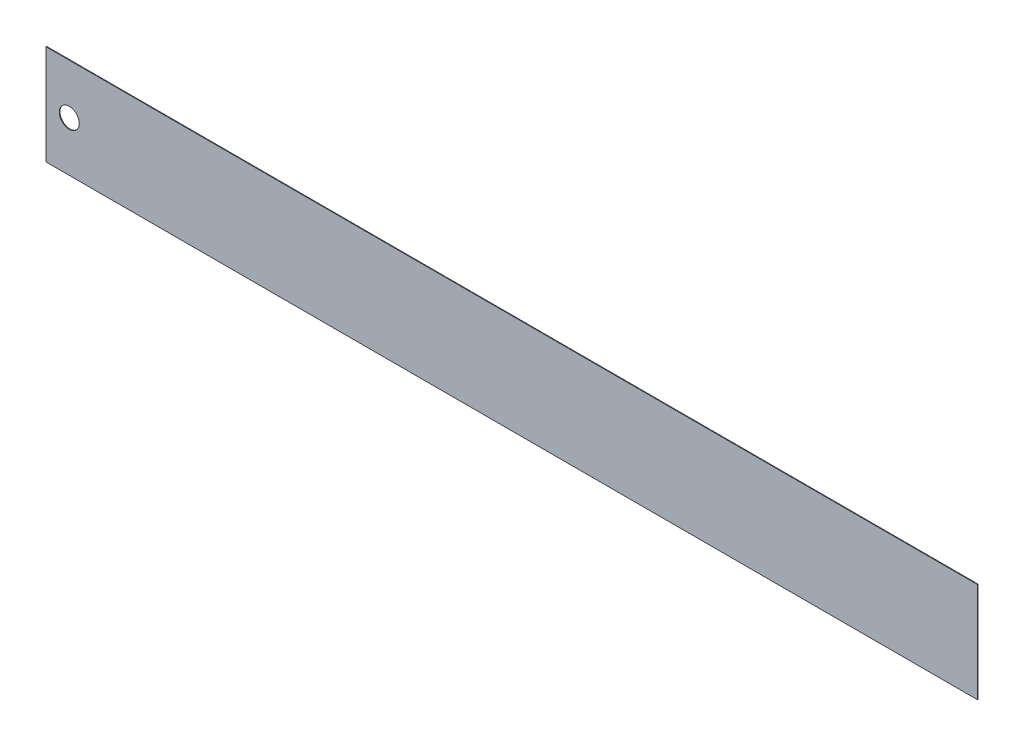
ISO-10303-21;
HEADER;
FILE_DESCRIPTION(('STEP AP214'),'2;1');
FILE_NAME('part.step','',(''),(''),'','','');
FILE_SCHEMA(('AUTOMOTIVE_DESIGN { 1 0 10303 214 1 1 1 1 }'));
ENDSEC;
DATA;
#1=APPLICATION_CONTEXT('core data for automotive mechanical design processes');
#2=APPLICATION_PROTOCOL_DEFINITION('international standard','automotive_design',2000,#1);
#3=PRODUCT_CONTEXT('',#1,'mechanical');
#4=PRODUCT('Part','Part','',(#3));
#5=PRODUCT_RELATED_PRODUCT_CATEGORY('part','',(#4));
#6=PRODUCT_DEFINITION_FORMATION('','',#4);
#7=PRODUCT_DEFINITION_CONTEXT('part definition',#1,'design');
#8=PRODUCT_DEFINITION('design','',#6,#7);
#9=PRODUCT_DEFINITION_SHAPE('','',#8);
#10=(LENGTH_UNIT() NAMED_UNIT(*) SI_UNIT(.MILLI.,.METRE.));
#11=(NAMED_UNIT(*) PLANE_ANGLE_UNIT() SI_UNIT($,.RADIAN.));
#12=(NAMED_UNIT(*) SI_UNIT($,.STERADIAN.) SOLID_ANGLE_UNIT());
#13=UNCERTAINTY_MEASURE_WITH_UNIT(LENGTH_MEASURE(1.E-05),#10,'distance_accuracy_value','');
#14=(GEOMETRIC_REPRESENTATION_CONTEXT(3) GLOBAL_UNCERTAINTY_ASSIGNED_CONTEXT((#13)) GLOBAL_UNIT_ASSIGNED_CONTEXT((#10,
#11,#12)) REPRESENTATION_CONTEXT('',''));
#15=CARTESIAN_POINT('',(0.,0.,0.));
#16=DIRECTION('',(0.,0.,1.));
#17=DIRECTION('',(1.,0.,0.));
#18=AXIS2_PLACEMENT_3D('',#15,#16,#17);
#19=CARTESIAN_POINT('',(0.,0.,0.1));
#20=DIRECTION('',(0.,0.,1.));
#21=DIRECTION('',(1.,0.,0.));
#22=AXIS2_PLACEMENT_3D('',#19,#20,#21);
#23=PLANE('',#22);
#24=DIRECTION('',(0.,-1.,0.));
#25=VECTOR('',#24,1.);
#26=CARTESIAN_POINT('',(-71.5183926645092,24.1197950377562,0.1));
#27=LINE('',#26,#25);
#28=CARTESIAN_POINT('',(-71.5183926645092,24.1197950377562,0.1));
#29=VERTEX_POINT('',#28);
#30=CARTESIAN_POINT('',(-71.5183926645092,9.1197950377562,0.1));
#31=VERTEX_POINT('',#30);
#32=EDGE_CURVE('E87',#29,#31,#27,.T.);
#33=ORIENTED_EDGE('',*,*,#32,.T.);
#34=DIRECTION('',(1.,0.,0.));
#35=VECTOR('',#34,1.);
#36=CARTESIAN_POINT('',(-71.5183926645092,9.1197950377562,0.1));
#37=LINE('',#36,#35);
#38=CARTESIAN_POINT('',(68.4816073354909,9.1197950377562,0.1));
#39=VERTEX_POINT('',#38);
#40=EDGE_CURVE('E82',#31,#39,#37,.T.);
#41=ORIENTED_EDGE('',*,*,#40,.T.);
#42=DIRECTION('',(0.,1.,0.));
#43=VECTOR('',#42,1.);
#44=CARTESIAN_POINT('',(68.4816073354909,24.1197950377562,0.1));
#45=LINE('',#44,#43);
#46=CARTESIAN_POINT('',(68.4816073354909,24.1197950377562,0.1));
#47=VERTEX_POINT('',#46);
#48=EDGE_CURVE('E85',#39,#47,#45,.T.);
#49=ORIENTED_EDGE('',*,*,#48,.T.);
#50=DIRECTION('',(-1.,0.,0.));
#51=VECTOR('',#50,1.);
#52=CARTESIAN_POINT('',(-71.5183926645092,24.1197950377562,0.1));
#53=LINE('',#52,#51);
#54=EDGE_CURVE('E52',#47,#29,#53,.T.);
#55=ORIENTED_EDGE('',*,*,#54,.T.);
#56=EDGE_LOOP('',(#33,#41,#49,#55));
#57=FACE_BOUND('',#56,.T.);
#58=CARTESIAN_POINT('',(-68.0183926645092,16.6197950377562,0.1));
#59=DIRECTION('',(0.,0.,1.));
#60=DIRECTION('',(1.,0.,0.));
#61=AXIS2_PLACEMENT_3D('',#58,#59,#60);
#62=CIRCLE('',#61,1.5);
#63=CARTESIAN_POINT('',(-66.5183926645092,16.6197950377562,0.1));
#64=VERTEX_POINT('',#63);
#65=EDGE_CURVE('E102',#64,#64,#62,.T.);
#66=ORIENTED_EDGE('',*,*,#65,.F.);
#67=EDGE_LOOP('',(#66));
#68=FACE_BOUND('',#67,.T.);
#69=ADVANCED_FACE('F35',(#57,#68),#23,.T.);
#70=CARTESIAN_POINT('',(0.,0.,0.));
#71=DIRECTION('',(0.,0.,1.));
#72=DIRECTION('',(1.,0.,0.));
#73=AXIS2_PLACEMENT_3D('',#70,#71,#72);
#74=PLANE('',#73);
#75=DIRECTION('',(0.,-1.,0.));
#76=VECTOR('',#75,1.);
#77=CARTESIAN_POINT('',(-71.5183926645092,24.1197950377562,0.));
#78=LINE('',#77,#76);
#79=CARTESIAN_POINT('',(-71.5183926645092,24.1197950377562,0.));
#80=VERTEX_POINT('',#79);
#81=CARTESIAN_POINT('',(-71.5183926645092,9.1197950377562,0.));
#82=VERTEX_POINT('',#81);
#83=EDGE_CURVE('E99',#80,#82,#78,.T.);
#84=ORIENTED_EDGE('',*,*,#83,.F.);
#85=DIRECTION('',(-1.,0.,0.));
#86=VECTOR('',#85,1.);
#87=CARTESIAN_POINT('',(-71.5183926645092,24.1197950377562,0.));
#88=LINE('',#87,#86);
#89=CARTESIAN_POINT('',(68.4816073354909,24.1197950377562,0.));
#90=VERTEX_POINT('',#89);
#91=EDGE_CURVE('E75',#90,#80,#88,.T.);
#92=ORIENTED_EDGE('',*,*,#91,.F.);
#93=DIRECTION('',(0.,1.,0.));
#94=VECTOR('',#93,1.);
#95=CARTESIAN_POINT('',(68.4816073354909,24.1197950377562,0.));
#96=LINE('',#95,#94);
#97=CARTESIAN_POINT('',(68.4816073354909,9.1197950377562,0.));
#98=VERTEX_POINT('',#97);
#99=EDGE_CURVE('E69',#98,#90,#96,.T.);
#100=ORIENTED_EDGE('',*,*,#99,.F.);
#101=DIRECTION('',(1.,0.,0.));
#102=VECTOR('',#101,1.);
#103=CARTESIAN_POINT('',(-71.5183926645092,9.1197950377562,0.));
#104=LINE('',#103,#102);
#105=EDGE_CURVE('E91',#82,#98,#104,.T.);
#106=ORIENTED_EDGE('',*,*,#105,.F.);
#107=EDGE_LOOP('',(#84,#92,#100,#106));
#108=FACE_BOUND('',#107,.T.);
#109=CARTESIAN_POINT('',(-68.0183926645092,16.6197950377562,0.));
#110=DIRECTION('',(0.,0.,1.));
#111=DIRECTION('',(1.,0.,0.));
#112=AXIS2_PLACEMENT_3D('',#109,#110,#111);
#113=CIRCLE('',#112,1.5);
#114=CARTESIAN_POINT('',(-66.5183926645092,16.6197950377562,0.));
#115=VERTEX_POINT('',#114);
#116=EDGE_CURVE('E114',#115,#115,#113,.T.);
#117=ORIENTED_EDGE('',*,*,#116,.T.);
#118=EDGE_LOOP('',(#117));
#119=FACE_BOUND('',#118,.T.);
#120=ADVANCED_FACE('F110',(#108,#119),#74,.F.);
#121=CARTESIAN_POINT('',(-71.5183926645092,24.1197950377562,0.1));
#122=DIRECTION('',(1.,0.,0.));
#123=DIRECTION('',(0.,0.,-1.));
#124=AXIS2_PLACEMENT_3D('',#121,#122,#123);
#125=PLANE('',#124);
#126=ORIENTED_EDGE('',*,*,#83,.T.);
#127=DIRECTION('',(0.,0.,-1.));
#128=VECTOR('',#127,1.);
#129=CARTESIAN_POINT('',(-71.5183926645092,9.1197950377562,0.1));
#130=LINE('',#129,#128);
#131=EDGE_CURVE('E11',#31,#82,#130,.T.);
#132=ORIENTED_EDGE('',*,*,#131,.F.);
#133=ORIENTED_EDGE('',*,*,#32,.F.);
#134=DIRECTION('',(0.,0.,-1.));
#135=VECTOR('',#134,1.);
#136=CARTESIAN_POINT('',(-71.5183926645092,24.1197950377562,0.1));
#137=LINE('',#136,#135);
#138=EDGE_CURVE('E95',#29,#80,#137,.T.);
#139=ORIENTED_EDGE('',*,*,#138,.T.);
#140=EDGE_LOOP('',(#126,#132,#133,#139));
#141=FACE_BOUND('',#140,.T.);
#142=ADVANCED_FACE('F37',(#141),#125,.F.);
#143=CARTESIAN_POINT('',(-71.5183926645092,9.1197950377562,0.1));
#144=DIRECTION('',(0.,1.,0.));
#145=DIRECTION('',(0.,0.,1.));
#146=AXIS2_PLACEMENT_3D('',#143,#144,#145);
#147=PLANE('',#146);
#148=ORIENTED_EDGE('',*,*,#105,.T.);
#149=DIRECTION('',(0.,0.,-1.));
#150=VECTOR('',#149,1.);
#151=CARTESIAN_POINT('',(68.4816073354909,9.1197950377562,0.1));
#152=LINE('',#151,#150);
#153=EDGE_CURVE('E44',#39,#98,#152,.T.);
#154=ORIENTED_EDGE('',*,*,#153,.F.);
#155=ORIENTED_EDGE('',*,*,#40,.F.);
#156=ORIENTED_EDGE('',*,*,#131,.T.);
#157=EDGE_LOOP('',(#148,#154,#155,#156));
#158=FACE_BOUND('',#157,.T.);
#159=ADVANCED_FACE('F90',(#158),#147,.F.);
#160=CARTESIAN_POINT('',(68.4816073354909,24.1197950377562,0.1));
#161=DIRECTION('',(-1.,0.,0.));
#162=DIRECTION('',(0.,0.,1.));
#163=AXIS2_PLACEMENT_3D('',#160,#161,#162);
#164=PLANE('',#163);
#165=ORIENTED_EDGE('',*,*,#99,.T.);
#166=DIRECTION('',(0.,0.,-1.));
#167=VECTOR('',#166,1.);
#168=CARTESIAN_POINT('',(68.4816073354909,24.1197950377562,0.1));
#169=LINE('',#168,#167);
#170=EDGE_CURVE('E92',#47,#90,#169,.T.);
#171=ORIENTED_EDGE('',*,*,#170,.F.);
#172=ORIENTED_EDGE('',*,*,#48,.F.);
#173=ORIENTED_EDGE('',*,*,#153,.T.);
#174=EDGE_LOOP('',(#165,#171,#172,#173));
#175=FACE_BOUND('',#174,.T.);
#176=ADVANCED_FACE('F93',(#175),#164,.F.);
#177=CARTESIAN_POINT('',(-71.5183926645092,24.1197950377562,0.1));
#178=DIRECTION('',(0.,-1.,0.));
#179=DIRECTION('',(0.,0.,-1.));
#180=AXIS2_PLACEMENT_3D('',#177,#178,#179);
#181=PLANE('',#180);
#182=ORIENTED_EDGE('',*,*,#91,.T.);
#183=ORIENTED_EDGE('',*,*,#138,.F.);
#184=ORIENTED_EDGE('',*,*,#54,.F.);
#185=ORIENTED_EDGE('',*,*,#170,.T.);
#186=EDGE_LOOP('',(#182,#183,#184,#185));
#187=FACE_BOUND('',#186,.T.);
#188=ADVANCED_FACE('F107',(#187),#181,.F.);
#189=CARTESIAN_POINT('',(-68.0183926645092,16.6197950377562,0.1));
#190=DIRECTION('',(0.,0.,-1.));
#191=DIRECTION('',(-1.,0.,0.));
#192=AXIS2_PLACEMENT_3D('',#189,#190,#191);
#193=CYLINDRICAL_SURFACE('',#192,1.5);
#194=ORIENTED_EDGE('',*,*,#65,.T.);
#195=EDGE_LOOP('',(#194));
#196=FACE_BOUND('',#195,.T.);
#197=ORIENTED_EDGE('',*,*,#116,.F.);
#198=EDGE_LOOP('',(#197));
#199=FACE_BOUND('',#198,.T.);
#200=ADVANCED_FACE('F120',(#196,#199),#193,.F.);
#201=CLOSED_SHELL('',(#69,#120,#142,#159,#176,#188,#200));
#202=MANIFOLD_SOLID_BREP('B2',#201);
#203=ADVANCED_BREP_SHAPE_REPRESENTATION('',(#18,#202),#14);
#204=SHAPE_DEFINITION_REPRESENTATION(#9,#203);
ENDSEC;
END-ISO-10303-21;
